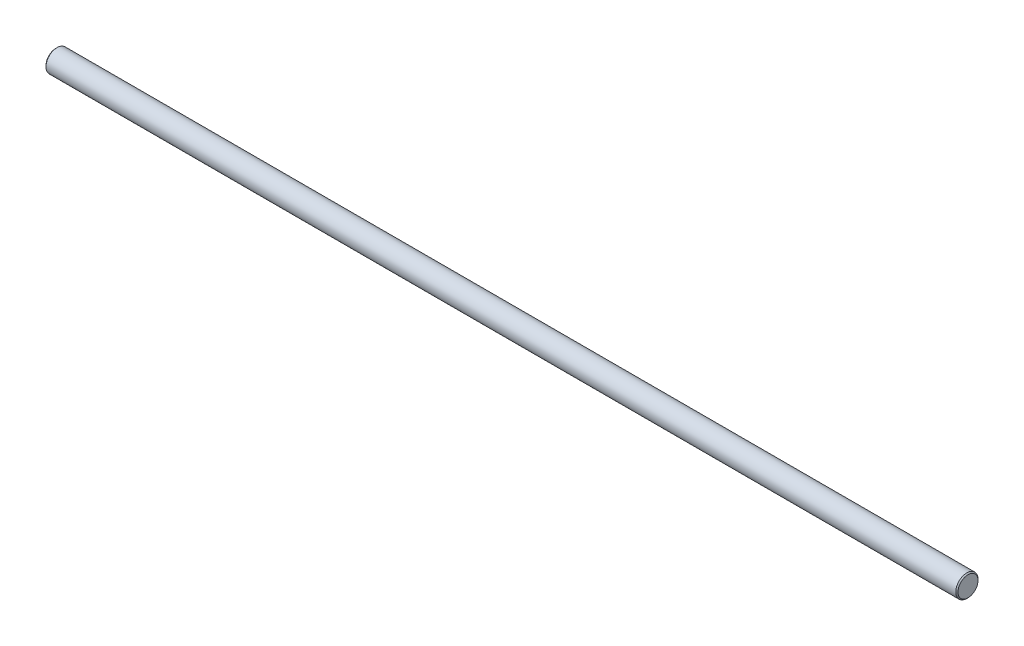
from build123d import *


with BuildPart() as part:
    # Sketch1 → Revolve1 (revolve)
    with BuildSketch(Plane.XY, mode=Mode.PRIVATE) as revolve1_sk:
        Polygon((0, 0), (0, 4.5), (0.5, 5), (409.5, 5), (410, 4.5), (410, 0), align=None)
    revolve(revolve1_sk.sketch.rotate(Axis((410, 0, 0), (-1, 0, 0)), 180), axis=Axis((410, 0, 0), (-1, 0, 0)))


solid = part.part
